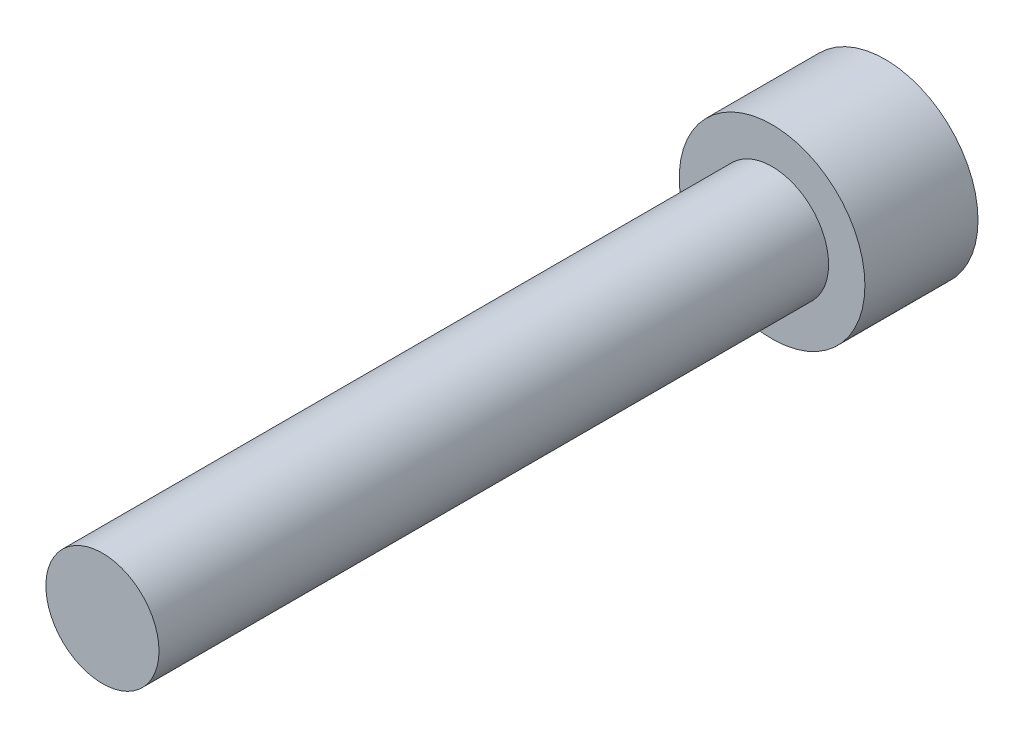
ISO-10303-21;
HEADER;
FILE_DESCRIPTION(('STEP AP214'),'2;1');
FILE_NAME('part.step','',(''),(''),'','','');
FILE_SCHEMA(('AUTOMOTIVE_DESIGN { 1 0 10303 214 1 1 1 1 }'));
ENDSEC;
DATA;
#1=APPLICATION_CONTEXT('core data for automotive mechanical design processes');
#2=APPLICATION_PROTOCOL_DEFINITION('international standard','automotive_design',2000,#1);
#3=PRODUCT_CONTEXT('',#1,'mechanical');
#4=PRODUCT('Part','Part','',(#3));
#5=PRODUCT_RELATED_PRODUCT_CATEGORY('part','',(#4));
#6=PRODUCT_DEFINITION_FORMATION('','',#4);
#7=PRODUCT_DEFINITION_CONTEXT('part definition',#1,'design');
#8=PRODUCT_DEFINITION('design','',#6,#7);
#9=PRODUCT_DEFINITION_SHAPE('','',#8);
#10=(LENGTH_UNIT() NAMED_UNIT(*) SI_UNIT(.MILLI.,.METRE.));
#11=(NAMED_UNIT(*) PLANE_ANGLE_UNIT() SI_UNIT($,.RADIAN.));
#12=(NAMED_UNIT(*) SI_UNIT($,.STERADIAN.) SOLID_ANGLE_UNIT());
#13=UNCERTAINTY_MEASURE_WITH_UNIT(LENGTH_MEASURE(1.E-05),#10,'distance_accuracy_value','');
#14=(GEOMETRIC_REPRESENTATION_CONTEXT(3) GLOBAL_UNCERTAINTY_ASSIGNED_CONTEXT((#13)) GLOBAL_UNIT_ASSIGNED_CONTEXT((#10,
#11,#12)) REPRESENTATION_CONTEXT('',''));
#15=CARTESIAN_POINT('',(0.,0.,0.));
#16=DIRECTION('',(0.,0.,1.));
#17=DIRECTION('',(1.,0.,0.));
#18=AXIS2_PLACEMENT_3D('',#15,#16,#17);
#19=CARTESIAN_POINT('',(0.,0.,28.575));
#20=DIRECTION('',(0.,0.,1.));
#21=DIRECTION('',(1.,0.,0.));
#22=AXIS2_PLACEMENT_3D('',#19,#20,#21);
#23=PLANE('',#22);
#24=CARTESIAN_POINT('',(0.,0.,28.575));
#25=DIRECTION('',(0.,0.,1.));
#26=DIRECTION('',(1.,0.,0.));
#27=AXIS2_PLACEMENT_3D('',#24,#25,#26);
#28=CIRCLE('',#27,2.413);
#29=CARTESIAN_POINT('',(2.413,0.,28.575));
#30=VERTEX_POINT('',#29);
#31=EDGE_CURVE('E11',#30,#30,#28,.T.);
#32=ORIENTED_EDGE('',*,*,#31,.T.);
#33=EDGE_LOOP('',(#32));
#34=FACE_BOUND('',#33,.T.);
#35=ADVANCED_FACE('F32',(#34),#23,.T.);
#36=CARTESIAN_POINT('',(0.,0.,28.575));
#37=DIRECTION('',(0.,0.,1.));
#38=DIRECTION('',(1.,0.,0.));
#39=AXIS2_PLACEMENT_3D('',#36,#37,#38);
#40=CYLINDRICAL_SURFACE('',#39,2.413);
#41=CARTESIAN_POINT('',(0.,0.,0.));
#42=DIRECTION('',(0.,0.,1.));
#43=DIRECTION('',(1.,0.,0.));
#44=AXIS2_PLACEMENT_3D('',#41,#42,#43);
#45=CIRCLE('',#44,2.413);
#46=CARTESIAN_POINT('',(2.413,0.,0.));
#47=VERTEX_POINT('',#46);
#48=EDGE_CURVE('E39',#47,#47,#45,.T.);
#49=ORIENTED_EDGE('',*,*,#48,.T.);
#50=EDGE_LOOP('',(#49));
#51=FACE_BOUND('',#50,.T.);
#52=ORIENTED_EDGE('',*,*,#31,.F.);
#53=EDGE_LOOP('',(#52));
#54=FACE_BOUND('',#53,.T.);
#55=ADVANCED_FACE('F146',(#51,#54),#40,.T.);
#56=CARTESIAN_POINT('',(0.,-2.413,0.));
#57=DIRECTION('',(0.,0.,1.));
#58=DIRECTION('',(1.,0.,0.));
#59=AXIS2_PLACEMENT_3D('',#56,#57,#58);
#60=PLANE('',#59);
#61=CARTESIAN_POINT('',(0.,0.,0.));
#62=DIRECTION('',(0.,0.,1.));
#63=DIRECTION('',(1.,0.,0.));
#64=AXIS2_PLACEMENT_3D('',#61,#62,#63);
#65=CIRCLE('',#64,3.9624);
#66=CARTESIAN_POINT('',(3.9624,0.,0.));
#67=VERTEX_POINT('',#66);
#68=EDGE_CURVE('E141',#67,#67,#65,.T.);
#69=ORIENTED_EDGE('',*,*,#68,.T.);
#70=EDGE_LOOP('',(#69));
#71=FACE_BOUND('',#70,.T.);
#72=ORIENTED_EDGE('',*,*,#48,.F.);
#73=EDGE_LOOP('',(#72));
#74=FACE_BOUND('',#73,.T.);
#75=ADVANCED_FACE('F149',(#71,#74),#60,.T.);
#76=CARTESIAN_POINT('',(0.,0.,28.575));
#77=DIRECTION('',(0.,0.,1.));
#78=DIRECTION('',(1.,0.,0.));
#79=AXIS2_PLACEMENT_3D('',#76,#77,#78);
#80=CYLINDRICAL_SURFACE('',#79,3.9624);
#81=CARTESIAN_POINT('',(0.,0.,-4.826));
#82=DIRECTION('',(0.,0.,1.));
#83=DIRECTION('',(1.,0.,0.));
#84=AXIS2_PLACEMENT_3D('',#81,#82,#83);
#85=CIRCLE('',#84,3.9624);
#86=CARTESIAN_POINT('',(3.9624,0.,-4.826));
#87=VERTEX_POINT('',#86);
#88=EDGE_CURVE('E133',#87,#87,#85,.T.);
#89=ORIENTED_EDGE('',*,*,#88,.T.);
#90=EDGE_LOOP('',(#89));
#91=FACE_BOUND('',#90,.T.);
#92=ORIENTED_EDGE('',*,*,#68,.F.);
#93=EDGE_LOOP('',(#92));
#94=FACE_BOUND('',#93,.T.);
#95=ADVANCED_FACE('F151',(#91,#94),#80,.T.);
#96=CARTESIAN_POINT('',(0.,-3.9624,-4.826));
#97=DIRECTION('',(0.,0.,-1.));
#98=DIRECTION('',(-1.,0.,0.));
#99=AXIS2_PLACEMENT_3D('',#96,#97,#98);
#100=PLANE('',#99);
#101=DIRECTION('',(0.866025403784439,-0.5,0.));
#102=VECTOR('',#101,1.);
#103=CARTESIAN_POINT('',(0.,2.28769270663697,-4.826));
#104=LINE('',#103,#102);
#105=CARTESIAN_POINT('',(0.,2.28769270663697,-4.826));
#106=VERTEX_POINT('',#105);
#107=CARTESIAN_POINT('',(1.9812,1.14384635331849,-4.826));
#108=VERTEX_POINT('',#107);
#109=EDGE_CURVE('E46',#106,#108,#104,.T.);
#110=ORIENTED_EDGE('',*,*,#109,.F.);
#111=DIRECTION('',(0.866025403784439,0.5,0.));
#112=VECTOR('',#111,1.);
#113=CARTESIAN_POINT('',(-1.9812,1.14384635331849,-4.826));
#114=LINE('',#113,#112);
#115=CARTESIAN_POINT('',(-1.9812,1.14384635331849,-4.826));
#116=VERTEX_POINT('',#115);
#117=EDGE_CURVE('E129',#116,#106,#114,.T.);
#118=ORIENTED_EDGE('',*,*,#117,.F.);
#119=DIRECTION('',(0.,1.,0.));
#120=VECTOR('',#119,1.);
#121=CARTESIAN_POINT('',(-1.9812,-1.14384635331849,-4.826));
#122=LINE('',#121,#120);
#123=CARTESIAN_POINT('',(-1.9812,-1.14384635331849,-4.826));
#124=VERTEX_POINT('',#123);
#125=EDGE_CURVE('E127',#124,#116,#122,.T.);
#126=ORIENTED_EDGE('',*,*,#125,.F.);
#127=DIRECTION('',(-0.866025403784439,0.5,0.));
#128=VECTOR('',#127,1.);
#129=CARTESIAN_POINT('',(0.,-2.28769270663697,-4.826));
#130=LINE('',#129,#128);
#131=CARTESIAN_POINT('',(0.,-2.28769270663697,-4.826));
#132=VERTEX_POINT('',#131);
#133=EDGE_CURVE('E94',#132,#124,#130,.T.);
#134=ORIENTED_EDGE('',*,*,#133,.F.);
#135=DIRECTION('',(-0.866025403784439,-0.5,0.));
#136=VECTOR('',#135,1.);
#137=CARTESIAN_POINT('',(1.9812,-1.14384635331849,-4.826));
#138=LINE('',#137,#136);
#139=CARTESIAN_POINT('',(1.9812,-1.14384635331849,-4.826));
#140=VERTEX_POINT('',#139);
#141=EDGE_CURVE('E123',#140,#132,#138,.T.);
#142=ORIENTED_EDGE('',*,*,#141,.F.);
#143=DIRECTION('',(0.,-1.,0.));
#144=VECTOR('',#143,1.);
#145=CARTESIAN_POINT('',(1.9812,1.14384635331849,-4.826));
#146=LINE('',#145,#144);
#147=EDGE_CURVE('E120',#108,#140,#146,.T.);
#148=ORIENTED_EDGE('',*,*,#147,.F.);
#149=EDGE_LOOP('',(#110,#118,#126,#134,#142,#148));
#150=FACE_BOUND('',#149,.T.);
#151=ORIENTED_EDGE('',*,*,#88,.F.);
#152=EDGE_LOOP('',(#151));
#153=FACE_BOUND('',#152,.T.);
#154=ADVANCED_FACE('F158',(#150,#153),#100,.T.);
#155=CARTESIAN_POINT('',(0.,2.28769270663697,-1.778));
#156=DIRECTION('',(0.5,0.866025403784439,0.));
#157=DIRECTION('',(-0.866025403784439,0.5,0.));
#158=AXIS2_PLACEMENT_3D('',#155,#156,#157);
#159=PLANE('',#158);
#160=ORIENTED_EDGE('',*,*,#109,.T.);
#161=DIRECTION('',(0.,0.,-1.));
#162=VECTOR('',#161,1.);
#163=CARTESIAN_POINT('',(1.9812,1.14384635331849,-1.778));
#164=LINE('',#163,#162);
#165=CARTESIAN_POINT('',(1.9812,1.14384635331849,-1.778));
#166=VERTEX_POINT('',#165);
#167=EDGE_CURVE('E76',#166,#108,#164,.T.);
#168=ORIENTED_EDGE('',*,*,#167,.F.);
#169=DIRECTION('',(0.866025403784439,-0.5,0.));
#170=VECTOR('',#169,1.);
#171=CARTESIAN_POINT('',(0.,2.28769270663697,-1.778));
#172=LINE('',#171,#170);
#173=CARTESIAN_POINT('',(0.,2.28769270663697,-1.778));
#174=VERTEX_POINT('',#173);
#175=EDGE_CURVE('E131',#174,#166,#172,.T.);
#176=ORIENTED_EDGE('',*,*,#175,.F.);
#177=DIRECTION('',(0.,0.,-1.));
#178=VECTOR('',#177,1.);
#179=CARTESIAN_POINT('',(0.,2.28769270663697,-1.778));
#180=LINE('',#179,#178);
#181=EDGE_CURVE('E54',#174,#106,#180,.T.);
#182=ORIENTED_EDGE('',*,*,#181,.T.);
#183=EDGE_LOOP('',(#160,#168,#176,#182));
#184=FACE_BOUND('',#183,.T.);
#185=ADVANCED_FACE('F189',(#184),#159,.F.);
#186=CARTESIAN_POINT('',(-1.9812,1.14384635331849,-1.778));
#187=DIRECTION('',(-0.5,0.866025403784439,0.));
#188=DIRECTION('',(-0.866025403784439,-0.5,0.));
#189=AXIS2_PLACEMENT_3D('',#186,#187,#188);
#190=PLANE('',#189);
#191=ORIENTED_EDGE('',*,*,#117,.T.);
#192=ORIENTED_EDGE('',*,*,#181,.F.);
#193=DIRECTION('',(0.866025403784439,0.5,0.));
#194=VECTOR('',#193,1.);
#195=CARTESIAN_POINT('',(-1.9812,1.14384635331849,-1.778));
#196=LINE('',#195,#194);
#197=CARTESIAN_POINT('',(-1.9812,1.14384635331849,-1.778));
#198=VERTEX_POINT('',#197);
#199=EDGE_CURVE('E106',#198,#174,#196,.T.);
#200=ORIENTED_EDGE('',*,*,#199,.F.);
#201=DIRECTION('',(0.,0.,-1.));
#202=VECTOR('',#201,1.);
#203=CARTESIAN_POINT('',(-1.9812,1.14384635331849,-1.778));
#204=LINE('',#203,#202);
#205=EDGE_CURVE('E98',#198,#116,#204,.T.);
#206=ORIENTED_EDGE('',*,*,#205,.T.);
#207=EDGE_LOOP('',(#191,#192,#200,#206));
#208=FACE_BOUND('',#207,.T.);
#209=ADVANCED_FACE('F199',(#208),#190,.F.);
#210=CARTESIAN_POINT('',(-1.9812,-1.14384635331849,-1.778));
#211=DIRECTION('',(-1.,0.,0.));
#212=DIRECTION('',(0.,-1.,0.));
#213=AXIS2_PLACEMENT_3D('',#210,#211,#212);
#214=PLANE('',#213);
#215=ORIENTED_EDGE('',*,*,#125,.T.);
#216=ORIENTED_EDGE('',*,*,#205,.F.);
#217=DIRECTION('',(0.,1.,0.));
#218=VECTOR('',#217,1.);
#219=CARTESIAN_POINT('',(-1.9812,-1.14384635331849,-1.778));
#220=LINE('',#219,#218);
#221=CARTESIAN_POINT('',(-1.9812,-1.14384635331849,-1.778));
#222=VERTEX_POINT('',#221);
#223=EDGE_CURVE('E102',#222,#198,#220,.T.);
#224=ORIENTED_EDGE('',*,*,#223,.F.);
#225=DIRECTION('',(0.,0.,-1.));
#226=VECTOR('',#225,1.);
#227=CARTESIAN_POINT('',(-1.9812,-1.14384635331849,-1.778));
#228=LINE('',#227,#226);
#229=EDGE_CURVE('E87',#222,#124,#228,.T.);
#230=ORIENTED_EDGE('',*,*,#229,.T.);
#231=EDGE_LOOP('',(#215,#216,#224,#230));
#232=FACE_BOUND('',#231,.T.);
#233=ADVANCED_FACE('F103',(#232),#214,.F.);
#234=CARTESIAN_POINT('',(0.,-2.28769270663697,-1.778));
#235=DIRECTION('',(-0.5,-0.866025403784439,0.));
#236=DIRECTION('',(0.866025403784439,-0.5,0.));
#237=AXIS2_PLACEMENT_3D('',#234,#235,#236);
#238=PLANE('',#237);
#239=ORIENTED_EDGE('',*,*,#133,.T.);
#240=ORIENTED_EDGE('',*,*,#229,.F.);
#241=DIRECTION('',(-0.866025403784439,0.5,0.));
#242=VECTOR('',#241,1.);
#243=CARTESIAN_POINT('',(0.,-2.28769270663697,-1.778));
#244=LINE('',#243,#242);
#245=CARTESIAN_POINT('',(0.,-2.28769270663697,-1.778));
#246=VERTEX_POINT('',#245);
#247=EDGE_CURVE('E91',#246,#222,#244,.T.);
#248=ORIENTED_EDGE('',*,*,#247,.F.);
#249=DIRECTION('',(0.,0.,-1.));
#250=VECTOR('',#249,1.);
#251=CARTESIAN_POINT('',(0.,-2.28769270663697,-1.778));
#252=LINE('',#251,#250);
#253=EDGE_CURVE('E99',#246,#132,#252,.T.);
#254=ORIENTED_EDGE('',*,*,#253,.T.);
#255=EDGE_LOOP('',(#239,#240,#248,#254));
#256=FACE_BOUND('',#255,.T.);
#257=ADVANCED_FACE('F89',(#256),#238,.F.);
#258=CARTESIAN_POINT('',(1.9812,-1.14384635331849,-1.778));
#259=DIRECTION('',(0.5,-0.866025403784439,0.));
#260=DIRECTION('',(0.866025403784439,0.5,0.));
#261=AXIS2_PLACEMENT_3D('',#258,#259,#260);
#262=PLANE('',#261);
#263=ORIENTED_EDGE('',*,*,#141,.T.);
#264=ORIENTED_EDGE('',*,*,#253,.F.);
#265=DIRECTION('',(-0.866025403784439,-0.5,0.));
#266=VECTOR('',#265,1.);
#267=CARTESIAN_POINT('',(1.9812,-1.14384635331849,-1.778));
#268=LINE('',#267,#266);
#269=CARTESIAN_POINT('',(1.9812,-1.14384635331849,-1.778));
#270=VERTEX_POINT('',#269);
#271=EDGE_CURVE('E112',#270,#246,#268,.T.);
#272=ORIENTED_EDGE('',*,*,#271,.F.);
#273=DIRECTION('',(0.,0.,-1.));
#274=VECTOR('',#273,1.);
#275=CARTESIAN_POINT('',(1.9812,-1.14384635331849,-1.778));
#276=LINE('',#275,#274);
#277=EDGE_CURVE('E136',#270,#140,#276,.T.);
#278=ORIENTED_EDGE('',*,*,#277,.T.);
#279=EDGE_LOOP('',(#263,#264,#272,#278));
#280=FACE_BOUND('',#279,.T.);
#281=ADVANCED_FACE('F224',(#280),#262,.F.);
#282=CARTESIAN_POINT('',(1.9812,1.14384635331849,-1.778));
#283=DIRECTION('',(1.,0.,0.));
#284=DIRECTION('',(0.,0.,-1.));
#285=AXIS2_PLACEMENT_3D('',#282,#283,#284);
#286=PLANE('',#285);
#287=ORIENTED_EDGE('',*,*,#147,.T.);
#288=ORIENTED_EDGE('',*,*,#277,.F.);
#289=DIRECTION('',(0.,-1.,0.));
#290=VECTOR('',#289,1.);
#291=CARTESIAN_POINT('',(1.9812,1.14384635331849,-1.778));
#292=LINE('',#291,#290);
#293=EDGE_CURVE('E114',#166,#270,#292,.T.);
#294=ORIENTED_EDGE('',*,*,#293,.F.);
#295=ORIENTED_EDGE('',*,*,#167,.T.);
#296=EDGE_LOOP('',(#287,#288,#294,#295));
#297=FACE_BOUND('',#296,.T.);
#298=ADVANCED_FACE('F233',(#297),#286,.F.);
#299=CARTESIAN_POINT('',(3.9624,0.,-1.778));
#300=DIRECTION('',(0.,0.,-1.));
#301=DIRECTION('',(-1.,0.,0.));
#302=AXIS2_PLACEMENT_3D('',#299,#300,#301);
#303=PLANE('',#302);
#304=ORIENTED_EDGE('',*,*,#175,.T.);
#305=ORIENTED_EDGE('',*,*,#293,.T.);
#306=ORIENTED_EDGE('',*,*,#271,.T.);
#307=ORIENTED_EDGE('',*,*,#247,.T.);
#308=ORIENTED_EDGE('',*,*,#223,.T.);
#309=ORIENTED_EDGE('',*,*,#199,.T.);
#310=EDGE_LOOP('',(#304,#305,#306,#307,#308,#309));
#311=FACE_BOUND('',#310,.T.);
#312=ADVANCED_FACE('F109',(#311),#303,.T.);
#313=CLOSED_SHELL('',(#35,#55,#75,#95,#154,#185,#209,#233,#257,#281,#298,#312));
#314=MANIFOLD_SOLID_BREP('B2',#313);
#315=ADVANCED_BREP_SHAPE_REPRESENTATION('',(#18,#314),#14);
#316=SHAPE_DEFINITION_REPRESENTATION(#9,#315);
ENDSEC;
END-ISO-10303-21;
